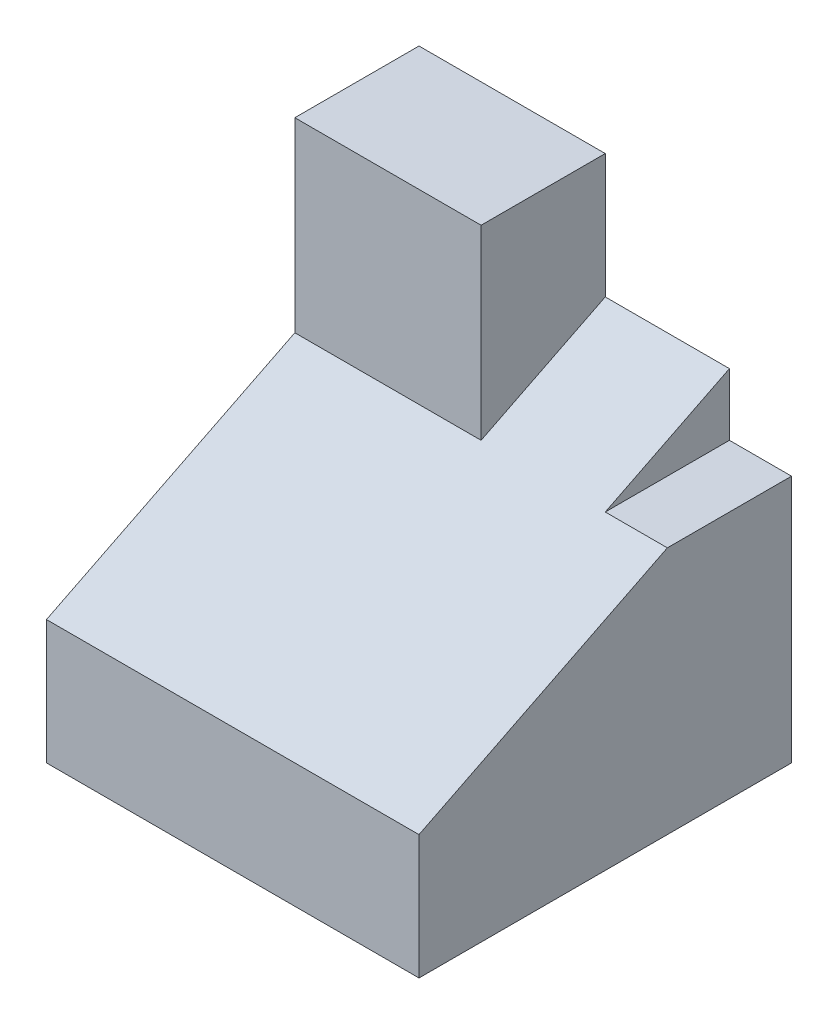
ISO-10303-21;
HEADER;
FILE_DESCRIPTION(('STEP AP214'),'2;1');
FILE_NAME('part.step','',(''),(''),'','','');
FILE_SCHEMA(('AUTOMOTIVE_DESIGN { 1 0 10303 214 1 1 1 1 }'));
ENDSEC;
DATA;
#1=APPLICATION_CONTEXT('core data for automotive mechanical design processes');
#2=APPLICATION_PROTOCOL_DEFINITION('international standard','automotive_design',2000,#1);
#3=PRODUCT_CONTEXT('',#1,'mechanical');
#4=PRODUCT('Part','Part','',(#3));
#5=PRODUCT_RELATED_PRODUCT_CATEGORY('part','',(#4));
#6=PRODUCT_DEFINITION_FORMATION('','',#4);
#7=PRODUCT_DEFINITION_CONTEXT('part definition',#1,'design');
#8=PRODUCT_DEFINITION('design','',#6,#7);
#9=PRODUCT_DEFINITION_SHAPE('','',#8);
#10=(LENGTH_UNIT() NAMED_UNIT(*) SI_UNIT(.MILLI.,.METRE.));
#11=(NAMED_UNIT(*) PLANE_ANGLE_UNIT() SI_UNIT($,.RADIAN.));
#12=(NAMED_UNIT(*) SI_UNIT($,.STERADIAN.) SOLID_ANGLE_UNIT());
#13=UNCERTAINTY_MEASURE_WITH_UNIT(LENGTH_MEASURE(1.E-05),#10,'distance_accuracy_value','');
#14=(GEOMETRIC_REPRESENTATION_CONTEXT(3) GLOBAL_UNCERTAINTY_ASSIGNED_CONTEXT((#13)) GLOBAL_UNIT_ASSIGNED_CONTEXT((#10,
#11,#12)) REPRESENTATION_CONTEXT('',''));
#15=CARTESIAN_POINT('',(0.,0.,0.));
#16=DIRECTION('',(0.,0.,1.));
#17=DIRECTION('',(1.,0.,0.));
#18=AXIS2_PLACEMENT_3D('',#15,#16,#17);
#19=CARTESIAN_POINT('',(-30.,35.,30.));
#20=DIRECTION('',(0.,-1.,0.));
#21=DIRECTION('',(0.,0.,-1.));
#22=AXIS2_PLACEMENT_3D('',#19,#20,#21);
#23=PLANE('',#22);
#24=DIRECTION('',(0.,0.,-1.));
#25=VECTOR('',#24,1.);
#26=CARTESIAN_POINT('',(0.,35.,-30.));
#27=LINE('',#26,#25);
#28=CARTESIAN_POINT('',(0.,35.,-9.99999999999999));
#29=VERTEX_POINT('',#28);
#30=CARTESIAN_POINT('',(0.,35.,-30.));
#31=VERTEX_POINT('',#30);
#32=EDGE_CURVE('E132',#29,#31,#27,.T.);
#33=ORIENTED_EDGE('',*,*,#32,.T.);
#34=DIRECTION('',(-1.,0.,0.));
#35=VECTOR('',#34,1.);
#36=CARTESIAN_POINT('',(-30.,35.,-30.));
#37=LINE('',#36,#35);
#38=CARTESIAN_POINT('',(-30.,35.,-30.));
#39=VERTEX_POINT('',#38);
#40=EDGE_CURVE('E158',#31,#39,#37,.T.);
#41=ORIENTED_EDGE('',*,*,#40,.T.);
#42=DIRECTION('',(0.,0.,-1.));
#43=VECTOR('',#42,1.);
#44=CARTESIAN_POINT('',(-30.,35.,30.));
#45=LINE('',#44,#43);
#46=CARTESIAN_POINT('',(-30.,35.,-9.99999999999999));
#47=VERTEX_POINT('',#46);
#48=EDGE_CURVE('E163',#47,#39,#45,.T.);
#49=ORIENTED_EDGE('',*,*,#48,.F.);
#50=DIRECTION('',(1.,0.,0.));
#51=VECTOR('',#50,1.);
#52=CARTESIAN_POINT('',(-30.,35.,-9.99999999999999));
#53=LINE('',#52,#51);
#54=EDGE_CURVE('E147',#47,#29,#53,.T.);
#55=ORIENTED_EDGE('',*,*,#54,.T.);
#56=EDGE_LOOP('',(#33,#41,#49,#55));
#57=FACE_BOUND('',#56,.T.);
#58=ADVANCED_FACE('F35',(#57),#23,.F.);
#59=CARTESIAN_POINT('',(-30.,35.,-9.99999999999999));
#60=DIRECTION('',(0.,0.,-1.));
#61=DIRECTION('',(0.,1.,0.));
#62=AXIS2_PLACEMENT_3D('',#59,#60,#61);
#63=PLANE('',#62);
#64=DIRECTION('',(0.,1.,0.));
#65=VECTOR('',#64,1.);
#66=CARTESIAN_POINT('',(0.,35.,-9.99999999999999));
#67=LINE('',#66,#65);
#68=CARTESIAN_POINT('',(0.,5.,-10.));
#69=VERTEX_POINT('',#68);
#70=EDGE_CURVE('E58',#69,#29,#67,.T.);
#71=ORIENTED_EDGE('',*,*,#70,.T.);
#72=ORIENTED_EDGE('',*,*,#54,.F.);
#73=DIRECTION('',(0.,1.,0.));
#74=VECTOR('',#73,1.);
#75=CARTESIAN_POINT('',(-30.,35.,-9.99999999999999));
#76=LINE('',#75,#74);
#77=CARTESIAN_POINT('',(-30.,4.99999999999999,-10.));
#78=VERTEX_POINT('',#77);
#79=EDGE_CURVE('E142',#78,#47,#76,.T.);
#80=ORIENTED_EDGE('',*,*,#79,.F.);
#81=DIRECTION('',(1.,0.,0.));
#82=VECTOR('',#81,1.);
#83=CARTESIAN_POINT('',(-30.,4.99999999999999,-10.));
#84=LINE('',#83,#82);
#85=EDGE_CURVE('E151',#78,#69,#84,.T.);
#86=ORIENTED_EDGE('',*,*,#85,.T.);
#87=EDGE_LOOP('',(#71,#72,#80,#86));
#88=FACE_BOUND('',#87,.T.);
#89=ADVANCED_FACE('F198',(#88),#63,.F.);
#90=CARTESIAN_POINT('',(-30.,35.,30.));
#91=DIRECTION('',(1.,0.,0.));
#92=DIRECTION('',(0.,1.,0.));
#93=AXIS2_PLACEMENT_3D('',#90,#91,#92);
#94=PLANE('',#93);
#95=DIRECTION('',(0.,0.447213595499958,-0.894427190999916));
#96=VECTOR('',#95,1.);
#97=CARTESIAN_POINT('',(-30.,4.99999999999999,-10.));
#98=LINE('',#97,#96);
#99=CARTESIAN_POINT('',(-30.,-15.,30.));
#100=VERTEX_POINT('',#99);
#101=EDGE_CURVE('E139',#100,#78,#98,.T.);
#102=ORIENTED_EDGE('',*,*,#101,.T.);
#103=ORIENTED_EDGE('',*,*,#79,.T.);
#104=ORIENTED_EDGE('',*,*,#48,.T.);
#105=DIRECTION('',(0.,-1.,0.));
#106=VECTOR('',#105,1.);
#107=CARTESIAN_POINT('',(-30.,35.,-30.));
#108=LINE('',#107,#106);
#109=CARTESIAN_POINT('',(-30.,-35.,-30.));
#110=VERTEX_POINT('',#109);
#111=EDGE_CURVE('E150',#39,#110,#108,.T.);
#112=ORIENTED_EDGE('',*,*,#111,.T.);
#113=DIRECTION('',(0.,0.,-1.));
#114=VECTOR('',#113,1.);
#115=CARTESIAN_POINT('',(-30.,-35.,30.));
#116=LINE('',#115,#114);
#117=CARTESIAN_POINT('',(-30.,-35.,30.));
#118=VERTEX_POINT('',#117);
#119=EDGE_CURVE('E12',#118,#110,#116,.T.);
#120=ORIENTED_EDGE('',*,*,#119,.F.);
#121=DIRECTION('',(0.,-1.,0.));
#122=VECTOR('',#121,1.);
#123=CARTESIAN_POINT('',(-30.,35.,30.));
#124=LINE('',#123,#122);
#125=EDGE_CURVE('E155',#100,#118,#124,.T.);
#126=ORIENTED_EDGE('',*,*,#125,.F.);
#127=EDGE_LOOP('',(#102,#103,#104,#112,#120,#126));
#128=FACE_BOUND('',#127,.T.);
#129=ADVANCED_FACE('F37',(#128),#94,.F.);
#130=CARTESIAN_POINT('',(-30.,-35.,30.));
#131=DIRECTION('',(0.,1.,0.));
#132=DIRECTION('',(0.,0.,1.));
#133=AXIS2_PLACEMENT_3D('',#130,#131,#132);
#134=PLANE('',#133);
#135=DIRECTION('',(1.,0.,0.));
#136=VECTOR('',#135,1.);
#137=CARTESIAN_POINT('',(-30.,-35.,-30.));
#138=LINE('',#137,#136);
#139=CARTESIAN_POINT('',(30.,-35.,-30.));
#140=VERTEX_POINT('',#139);
#141=EDGE_CURVE('E166',#110,#140,#138,.T.);
#142=ORIENTED_EDGE('',*,*,#141,.T.);
#143=DIRECTION('',(0.,0.,-1.));
#144=VECTOR('',#143,1.);
#145=CARTESIAN_POINT('',(30.,-35.,30.));
#146=LINE('',#145,#144);
#147=CARTESIAN_POINT('',(30.,-35.,30.));
#148=VERTEX_POINT('',#147);
#149=EDGE_CURVE('E43',#148,#140,#146,.T.);
#150=ORIENTED_EDGE('',*,*,#149,.F.);
#151=DIRECTION('',(1.,0.,0.));
#152=VECTOR('',#151,1.);
#153=CARTESIAN_POINT('',(-30.,-35.,30.));
#154=LINE('',#153,#152);
#155=EDGE_CURVE('E157',#118,#148,#154,.T.);
#156=ORIENTED_EDGE('',*,*,#155,.F.);
#157=ORIENTED_EDGE('',*,*,#119,.T.);
#158=EDGE_LOOP('',(#142,#150,#156,#157));
#159=FACE_BOUND('',#158,.T.);
#160=ADVANCED_FACE('F191',(#159),#134,.F.);
#161=CARTESIAN_POINT('',(30.,35.,30.));
#162=DIRECTION('',(-1.,0.,0.));
#163=DIRECTION('',(0.,-1.,0.));
#164=AXIS2_PLACEMENT_3D('',#161,#162,#163);
#165=PLANE('',#164);
#166=DIRECTION('',(0.,1.,0.));
#167=VECTOR('',#166,1.);
#168=CARTESIAN_POINT('',(30.,35.,-30.));
#169=LINE('',#168,#167);
#170=CARTESIAN_POINT('',(30.,5.00000000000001,-30.));
#171=VERTEX_POINT('',#170);
#172=EDGE_CURVE('E168',#140,#171,#169,.T.);
#173=ORIENTED_EDGE('',*,*,#172,.T.);
#174=DIRECTION('',(0.,0.,-1.));
#175=VECTOR('',#174,1.);
#176=CARTESIAN_POINT('',(30.,5.00000000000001,-10.));
#177=LINE('',#176,#175);
#178=CARTESIAN_POINT('',(30.,5.00000000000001,-10.));
#179=VERTEX_POINT('',#178);
#180=EDGE_CURVE('E184',#179,#171,#177,.T.);
#181=ORIENTED_EDGE('',*,*,#180,.F.);
#182=DIRECTION('',(0.,0.447213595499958,-0.894427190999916));
#183=VECTOR('',#182,1.);
#184=CARTESIAN_POINT('',(30.,5.,-10.));
#185=LINE('',#184,#183);
#186=CARTESIAN_POINT('',(30.,-15.,30.));
#187=VERTEX_POINT('',#186);
#188=EDGE_CURVE('E123',#187,#179,#185,.T.);
#189=ORIENTED_EDGE('',*,*,#188,.F.);
#190=DIRECTION('',(0.,1.,0.));
#191=VECTOR('',#190,1.);
#192=CARTESIAN_POINT('',(30.,35.,30.));
#193=LINE('',#192,#191);
#194=EDGE_CURVE('E160',#148,#187,#193,.T.);
#195=ORIENTED_EDGE('',*,*,#194,.F.);
#196=ORIENTED_EDGE('',*,*,#149,.T.);
#197=EDGE_LOOP('',(#173,#181,#189,#195,#196));
#198=FACE_BOUND('',#197,.T.);
#199=ADVANCED_FACE('F178',(#198),#165,.F.);
#200=CARTESIAN_POINT('',(0.,0.,30.));
#201=DIRECTION('',(0.,0.,1.));
#202=DIRECTION('',(1.,0.,0.));
#203=AXIS2_PLACEMENT_3D('',#200,#201,#202);
#204=PLANE('',#203);
#205=DIRECTION('',(1.,0.,0.));
#206=VECTOR('',#205,1.);
#207=CARTESIAN_POINT('',(-30.,-15.,30.));
#208=LINE('',#207,#206);
#209=EDGE_CURVE('E145',#100,#187,#208,.T.);
#210=ORIENTED_EDGE('',*,*,#209,.F.);
#211=ORIENTED_EDGE('',*,*,#125,.T.);
#212=ORIENTED_EDGE('',*,*,#155,.T.);
#213=ORIENTED_EDGE('',*,*,#194,.T.);
#214=EDGE_LOOP('',(#210,#211,#212,#213));
#215=FACE_BOUND('',#214,.T.);
#216=ADVANCED_FACE('F188',(#215),#204,.T.);
#217=CARTESIAN_POINT('',(0.,0.,-30.));
#218=DIRECTION('',(0.,0.,1.));
#219=DIRECTION('',(1.,0.,0.));
#220=AXIS2_PLACEMENT_3D('',#217,#218,#219);
#221=PLANE('',#220);
#222=DIRECTION('',(0.,1.,0.));
#223=VECTOR('',#222,1.);
#224=CARTESIAN_POINT('',(20.,5.,-30.));
#225=LINE('',#224,#223);
#226=CARTESIAN_POINT('',(20.,5.,-30.));
#227=VERTEX_POINT('',#226);
#228=CARTESIAN_POINT('',(20.,15.,-30.));
#229=VERTEX_POINT('',#228);
#230=EDGE_CURVE('E50',#227,#229,#225,.T.);
#231=ORIENTED_EDGE('',*,*,#230,.F.);
#232=DIRECTION('',(1.,0.,0.));
#233=VECTOR('',#232,1.);
#234=CARTESIAN_POINT('',(20.,5.,-30.));
#235=LINE('',#234,#233);
#236=EDGE_CURVE('E118',#227,#171,#235,.T.);
#237=ORIENTED_EDGE('',*,*,#236,.T.);
#238=ORIENTED_EDGE('',*,*,#172,.F.);
#239=ORIENTED_EDGE('',*,*,#141,.F.);
#240=ORIENTED_EDGE('',*,*,#111,.F.);
#241=ORIENTED_EDGE('',*,*,#40,.F.);
#242=DIRECTION('',(0.,-1.,0.));
#243=VECTOR('',#242,1.);
#244=CARTESIAN_POINT('',(0.,15.,-30.));
#245=LINE('',#244,#243);
#246=CARTESIAN_POINT('',(0.,15.,-30.));
#247=VERTEX_POINT('',#246);
#248=EDGE_CURVE('E129',#31,#247,#245,.T.);
#249=ORIENTED_EDGE('',*,*,#248,.T.);
#250=DIRECTION('',(1.,0.,0.));
#251=VECTOR('',#250,1.);
#252=CARTESIAN_POINT('',(-66.0555127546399,15.,-30.));
#253=LINE('',#252,#251);
#254=EDGE_CURVE('E125',#247,#229,#253,.T.);
#255=ORIENTED_EDGE('',*,*,#254,.T.);
#256=EDGE_LOOP('',(#231,#237,#238,#239,#240,#241,#249,#255));
#257=FACE_BOUND('',#256,.T.);
#258=ADVANCED_FACE('F182',(#257),#221,.F.);
#259=CARTESIAN_POINT('',(-30.,4.99999999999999,-10.));
#260=DIRECTION('',(0.,-0.894427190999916,-0.447213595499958));
#261=DIRECTION('',(0.,0.447213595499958,-0.894427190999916));
#262=AXIS2_PLACEMENT_3D('',#259,#260,#261);
#263=PLANE('',#262);
#264=ORIENTED_EDGE('',*,*,#188,.T.);
#265=DIRECTION('',(1.,0.,0.));
#266=VECTOR('',#265,1.);
#267=CARTESIAN_POINT('',(20.,5.,-10.));
#268=LINE('',#267,#266);
#269=CARTESIAN_POINT('',(20.,5.,-10.));
#270=VERTEX_POINT('',#269);
#271=EDGE_CURVE('E115',#270,#179,#268,.T.);
#272=ORIENTED_EDGE('',*,*,#271,.F.);
#273=DIRECTION('',(0.,-0.447213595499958,0.894427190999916));
#274=VECTOR('',#273,1.);
#275=CARTESIAN_POINT('',(20.,15.,-30.));
#276=LINE('',#275,#274);
#277=EDGE_CURVE('E105',#229,#270,#276,.T.);
#278=ORIENTED_EDGE('',*,*,#277,.F.);
#279=ORIENTED_EDGE('',*,*,#254,.F.);
#280=DIRECTION('',(0.,-0.447213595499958,0.894427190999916));
#281=VECTOR('',#280,1.);
#282=CARTESIAN_POINT('',(0.,5.,-10.));
#283=LINE('',#282,#281);
#284=EDGE_CURVE('E136',#247,#69,#283,.T.);
#285=ORIENTED_EDGE('',*,*,#284,.T.);
#286=ORIENTED_EDGE('',*,*,#85,.F.);
#287=ORIENTED_EDGE('',*,*,#101,.F.);
#288=ORIENTED_EDGE('',*,*,#209,.T.);
#289=EDGE_LOOP('',(#264,#272,#278,#279,#285,#286,#287,#288));
#290=FACE_BOUND('',#289,.T.);
#291=ADVANCED_FACE('F121',(#290),#263,.F.);
#292=CARTESIAN_POINT('',(0.,35.,30.));
#293=DIRECTION('',(1.,0.,0.));
#294=DIRECTION('',(0.,1.,0.));
#295=AXIS2_PLACEMENT_3D('',#292,#293,#294);
#296=PLANE('',#295);
#297=ORIENTED_EDGE('',*,*,#70,.F.);
#298=ORIENTED_EDGE('',*,*,#284,.F.);
#299=ORIENTED_EDGE('',*,*,#248,.F.);
#300=ORIENTED_EDGE('',*,*,#32,.F.);
#301=EDGE_LOOP('',(#297,#298,#299,#300));
#302=FACE_BOUND('',#301,.T.);
#303=ADVANCED_FACE('F196',(#302),#296,.T.);
#304=CARTESIAN_POINT('',(20.,5.,-10.));
#305=DIRECTION('',(0.,-1.,0.));
#306=DIRECTION('',(1.,0.,0.));
#307=AXIS2_PLACEMENT_3D('',#304,#305,#306);
#308=PLANE('',#307);
#309=ORIENTED_EDGE('',*,*,#180,.T.);
#310=ORIENTED_EDGE('',*,*,#236,.F.);
#311=DIRECTION('',(0.,0.,-1.));
#312=VECTOR('',#311,1.);
#313=CARTESIAN_POINT('',(20.,5.,-10.));
#314=LINE('',#313,#312);
#315=EDGE_CURVE('E108',#270,#227,#314,.T.);
#316=ORIENTED_EDGE('',*,*,#315,.F.);
#317=ORIENTED_EDGE('',*,*,#271,.T.);
#318=EDGE_LOOP('',(#309,#310,#316,#317));
#319=FACE_BOUND('',#318,.T.);
#320=ADVANCED_FACE('F114',(#319),#308,.F.);
#321=CARTESIAN_POINT('',(20.,0.,0.));
#322=DIRECTION('',(-1.,0.,0.));
#323=DIRECTION('',(0.,-1.,0.));
#324=AXIS2_PLACEMENT_3D('',#321,#322,#323);
#325=PLANE('',#324);
#326=ORIENTED_EDGE('',*,*,#230,.T.);
#327=ORIENTED_EDGE('',*,*,#277,.T.);
#328=ORIENTED_EDGE('',*,*,#315,.T.);
#329=EDGE_LOOP('',(#326,#327,#328));
#330=FACE_BOUND('',#329,.T.);
#331=ADVANCED_FACE('F107',(#330),#325,.F.);
#332=CLOSED_SHELL('',(#58,#89,#129,#160,#199,#216,#258,#291,#303,#320,#331));
#333=MANIFOLD_SOLID_BREP('B2',#332);
#334=ADVANCED_BREP_SHAPE_REPRESENTATION('',(#18,#333),#14);
#335=SHAPE_DEFINITION_REPRESENTATION(#9,#334);
ENDSEC;
END-ISO-10303-21;
